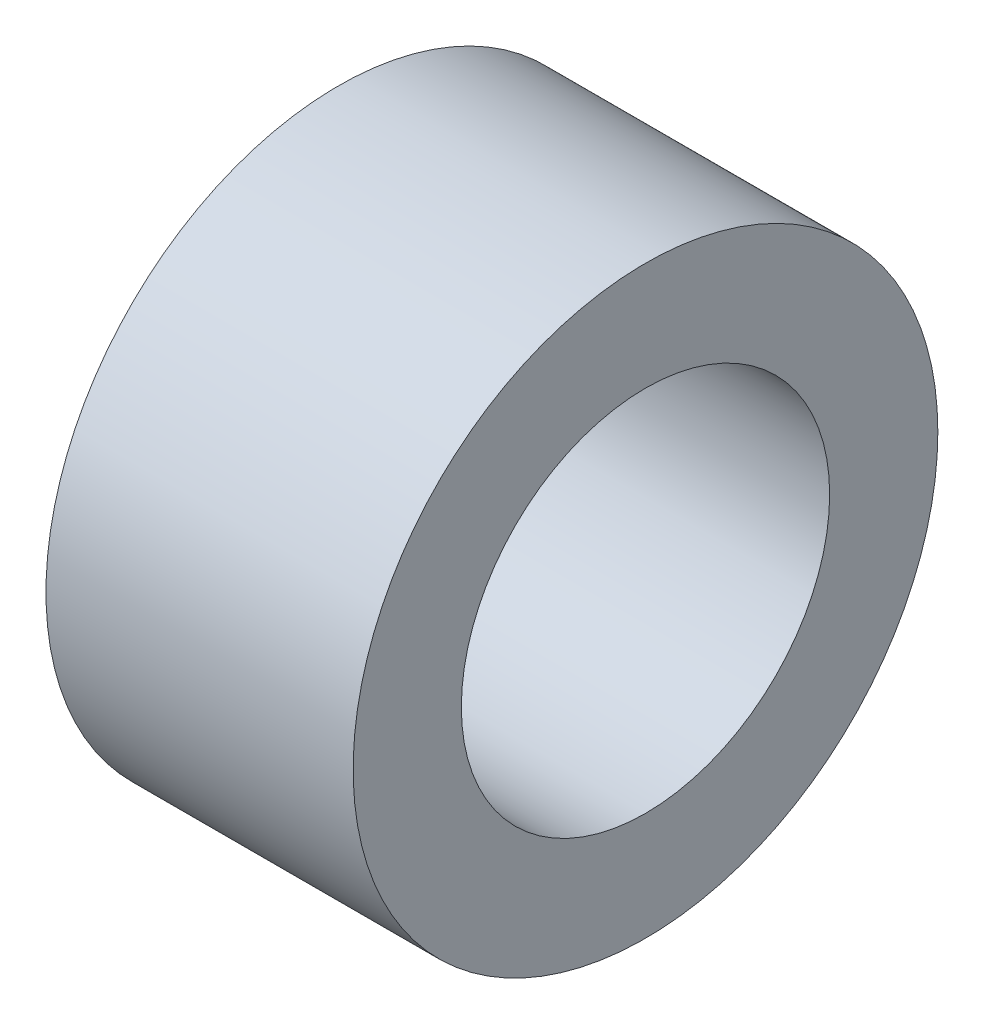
from build123d import *

# Parameters (mm, degrees)
SKETCH1_R    = 9.525
SKETCH1_R_2  = 6
SPACER_DEPTH = 10.0076


with BuildPart() as part:
    # Sketch1 → Spacer (new body)
    with BuildSketch(Plane(origin=(0, 0, 0), x_dir=(0, 0, -1), z_dir=(1, 0, 0))):
        Circle(SKETCH1_R)
        Circle(SKETCH1_R_2, mode=Mode.SUBTRACT)
    extrude(amount=SPACER_DEPTH)


solid = part.part
